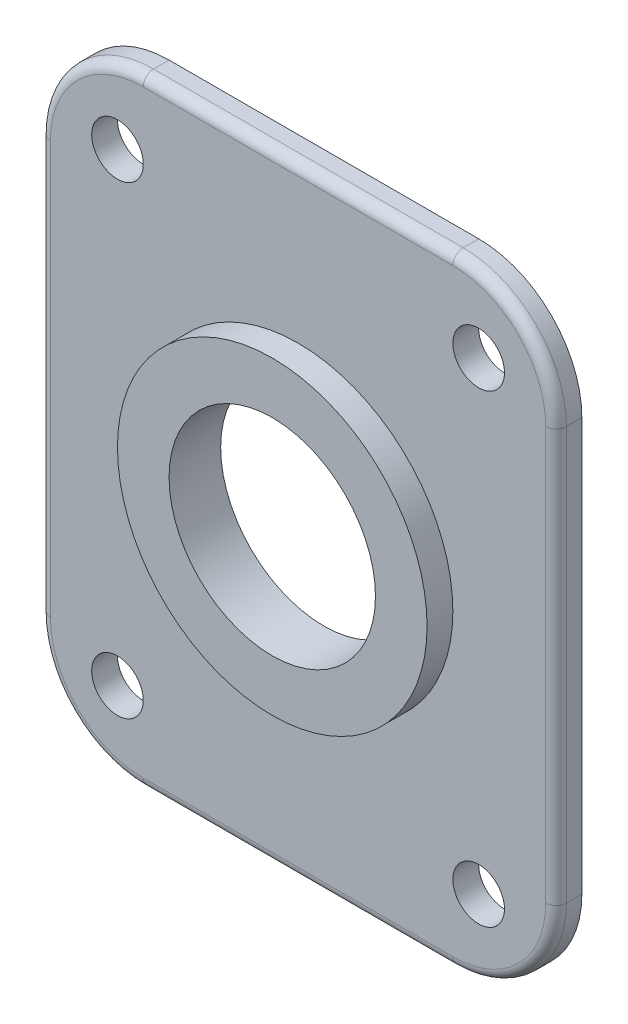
ISO-10303-21;
HEADER;
FILE_DESCRIPTION(('STEP AP214'),'2;1');
FILE_NAME('part.step','',(''),(''),'','','');
FILE_SCHEMA(('AUTOMOTIVE_DESIGN { 1 0 10303 214 1 1 1 1 }'));
ENDSEC;
DATA;
#1=APPLICATION_CONTEXT('core data for automotive mechanical design processes');
#2=APPLICATION_PROTOCOL_DEFINITION('international standard','automotive_design',2000,#1);
#3=PRODUCT_CONTEXT('',#1,'mechanical');
#4=PRODUCT('Part','Part','',(#3));
#5=PRODUCT_RELATED_PRODUCT_CATEGORY('part','',(#4));
#6=PRODUCT_DEFINITION_FORMATION('','',#4);
#7=PRODUCT_DEFINITION_CONTEXT('part definition',#1,'design');
#8=PRODUCT_DEFINITION('design','',#6,#7);
#9=PRODUCT_DEFINITION_SHAPE('','',#8);
#10=(LENGTH_UNIT() NAMED_UNIT(*) SI_UNIT(.MILLI.,.METRE.));
#11=(NAMED_UNIT(*) PLANE_ANGLE_UNIT() SI_UNIT($,.RADIAN.));
#12=(NAMED_UNIT(*) SI_UNIT($,.STERADIAN.) SOLID_ANGLE_UNIT());
#13=UNCERTAINTY_MEASURE_WITH_UNIT(LENGTH_MEASURE(1.E-05),#10,'distance_accuracy_value','');
#14=(GEOMETRIC_REPRESENTATION_CONTEXT(3) GLOBAL_UNCERTAINTY_ASSIGNED_CONTEXT((#13)) GLOBAL_UNIT_ASSIGNED_CONTEXT((#10,
#11,#12)) REPRESENTATION_CONTEXT('',''));
#15=CARTESIAN_POINT('',(0.,0.,0.));
#16=DIRECTION('',(0.,0.,1.));
#17=DIRECTION('',(1.,0.,0.));
#18=AXIS2_PLACEMENT_3D('',#15,#16,#17);
#19=CARTESIAN_POINT('',(-45.3917050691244,14.3317972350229,5.));
#20=DIRECTION('',(-1.,0.,0.));
#21=DIRECTION('',(0.,-1.,0.));
#22=AXIS2_PLACEMENT_3D('',#19,#20,#21);
#23=PLANE('',#22);
#24=DIRECTION('',(0.,0.,-1.));
#25=VECTOR('',#24,1.);
#26=CARTESIAN_POINT('',(-45.3917050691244,14.3317972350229,5.));
#27=LINE('',#26,#25);
#28=CARTESIAN_POINT('',(-45.3917050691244,14.3317972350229,3.));
#29=VERTEX_POINT('',#28);
#30=CARTESIAN_POINT('',(-45.3917050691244,14.3317972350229,0.));
#31=VERTEX_POINT('',#30);
#32=EDGE_CURVE('E202',#29,#31,#27,.T.);
#33=ORIENTED_EDGE('',*,*,#32,.F.);
#34=DIRECTION('',(0.,1.,0.));
#35=VECTOR('',#34,1.);
#36=CARTESIAN_POINT('',(-45.3917050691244,-65.6682027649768,3.));
#37=LINE('',#36,#35);
#38=CARTESIAN_POINT('',(-45.3917050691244,-65.6682027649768,3.));
#39=VERTEX_POINT('',#38);
#40=EDGE_CURVE('E46',#29,#39,#37,.F.);
#41=ORIENTED_EDGE('',*,*,#40,.T.);
#42=DIRECTION('',(0.,0.,-1.));
#43=VECTOR('',#42,1.);
#44=CARTESIAN_POINT('',(-45.3917050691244,-65.6682027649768,5.));
#45=LINE('',#44,#43);
#46=CARTESIAN_POINT('',(-45.3917050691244,-65.6682027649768,0.));
#47=VERTEX_POINT('',#46);
#48=EDGE_CURVE('E174',#39,#47,#45,.T.);
#49=ORIENTED_EDGE('',*,*,#48,.T.);
#50=DIRECTION('',(0.,1.,0.));
#51=VECTOR('',#50,1.);
#52=CARTESIAN_POINT('',(-45.3917050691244,14.3317972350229,0.));
#53=LINE('',#52,#51);
#54=EDGE_CURVE('E191',#47,#31,#53,.T.);
#55=ORIENTED_EDGE('',*,*,#54,.T.);
#56=EDGE_LOOP('',(#33,#41,#49,#55));
#57=FACE_BOUND('',#56,.T.);
#58=ADVANCED_FACE('F37',(#57),#23,.F.);
#59=CARTESIAN_POINT('',(-65.3917050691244,14.331797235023,5.));
#60=DIRECTION('',(0.,0.,-1.));
#61=DIRECTION('',(-1.,0.,0.));
#62=AXIS2_PLACEMENT_3D('',#59,#60,#61);
#63=CYLINDRICAL_SURFACE('',#62,20.);
#64=DIRECTION('',(0.,0.,-1.));
#65=VECTOR('',#64,1.);
#66=CARTESIAN_POINT('',(-65.3917050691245,34.331797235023,5.));
#67=LINE('',#66,#65);
#68=CARTESIAN_POINT('',(-65.3917050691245,34.331797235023,3.));
#69=VERTEX_POINT('',#68);
#70=CARTESIAN_POINT('',(-65.3917050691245,34.331797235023,0.));
#71=VERTEX_POINT('',#70);
#72=EDGE_CURVE('E200',#69,#71,#67,.T.);
#73=ORIENTED_EDGE('',*,*,#72,.F.);
#74=CARTESIAN_POINT('',(-65.3917050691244,14.331797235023,3.));
#75=DIRECTION('',(0.,0.,1.));
#76=DIRECTION('',(1.,0.,0.));
#77=AXIS2_PLACEMENT_3D('',#74,#75,#76);
#78=CIRCLE('',#77,20.);
#79=EDGE_CURVE('E11',#69,#29,#78,.F.);
#80=ORIENTED_EDGE('',*,*,#79,.T.);
#81=ORIENTED_EDGE('',*,*,#32,.T.);
#82=CARTESIAN_POINT('',(-65.3917050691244,14.331797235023,0.));
#83=DIRECTION('',(0.,0.,1.));
#84=DIRECTION('',(1.,0.,0.));
#85=AXIS2_PLACEMENT_3D('',#82,#83,#84);
#86=CIRCLE('',#85,20.);
#87=EDGE_CURVE('E194',#31,#71,#86,.T.);
#88=ORIENTED_EDGE('',*,*,#87,.T.);
#89=EDGE_LOOP('',(#73,#80,#81,#88));
#90=FACE_BOUND('',#89,.T.);
#91=ADVANCED_FACE('F310',(#90),#63,.T.);
#92=CARTESIAN_POINT('',(-95.3917050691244,34.331797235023,5.));
#93=DIRECTION('',(0.,-1.,0.));
#94=DIRECTION('',(0.,0.,-1.));
#95=AXIS2_PLACEMENT_3D('',#92,#93,#94);
#96=PLANE('',#95);
#97=DIRECTION('',(0.,0.,-1.));
#98=VECTOR('',#97,1.);
#99=CARTESIAN_POINT('',(-125.391705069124,34.331797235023,5.));
#100=LINE('',#99,#98);
#101=CARTESIAN_POINT('',(-125.391705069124,34.331797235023,3.));
#102=VERTEX_POINT('',#101);
#103=CARTESIAN_POINT('',(-125.391705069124,34.331797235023,0.));
#104=VERTEX_POINT('',#103);
#105=EDGE_CURVE('E182',#102,#104,#100,.T.);
#106=ORIENTED_EDGE('',*,*,#105,.F.);
#107=DIRECTION('',(-1.,0.,0.));
#108=VECTOR('',#107,1.);
#109=CARTESIAN_POINT('',(-65.3917050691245,34.331797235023,3.));
#110=LINE('',#109,#108);
#111=EDGE_CURVE('E229',#102,#69,#110,.F.);
#112=ORIENTED_EDGE('',*,*,#111,.T.);
#113=ORIENTED_EDGE('',*,*,#72,.T.);
#114=DIRECTION('',(-1.,0.,0.));
#115=VECTOR('',#114,1.);
#116=CARTESIAN_POINT('',(-95.3917050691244,34.331797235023,0.));
#117=LINE('',#116,#115);
#118=EDGE_CURVE('E197',#71,#104,#117,.T.);
#119=ORIENTED_EDGE('',*,*,#118,.T.);
#120=EDGE_LOOP('',(#106,#112,#113,#119));
#121=FACE_BOUND('',#120,.T.);
#122=ADVANCED_FACE('F280',(#121),#96,.F.);
#123=CARTESIAN_POINT('',(-65.3917050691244,14.331797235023,5.));
#124=DIRECTION('',(0.,0.,1.));
#125=DIRECTION('',(1.,0.,0.));
#126=AXIS2_PLACEMENT_3D('',#123,#124,#125);
#127=PLANE('',#126);
#128=DIRECTION('',(0.,1.,0.));
#129=VECTOR('',#128,1.);
#130=CARTESIAN_POINT('',(-143.391705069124,-65.6682027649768,5.));
#131=LINE('',#130,#129);
#132=CARTESIAN_POINT('',(-143.391705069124,14.3317972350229,5.));
#133=VERTEX_POINT('',#132);
#134=CARTESIAN_POINT('',(-143.391705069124,-65.6682027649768,5.));
#135=VERTEX_POINT('',#134);
#136=EDGE_CURVE('E219',#133,#135,#131,.F.);
#137=ORIENTED_EDGE('',*,*,#136,.T.);
#138=CARTESIAN_POINT('',(-125.391705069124,-65.6682027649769,5.));
#139=DIRECTION('',(0.,0.,1.));
#140=DIRECTION('',(1.,0.,0.));
#141=AXIS2_PLACEMENT_3D('',#138,#139,#140);
#142=CIRCLE('',#141,18.);
#143=CARTESIAN_POINT('',(-125.391705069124,-83.668202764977,5.));
#144=VERTEX_POINT('',#143);
#145=EDGE_CURVE('E221',#135,#144,#142,.T.);
#146=ORIENTED_EDGE('',*,*,#145,.T.);
#147=DIRECTION('',(-1.,0.,0.));
#148=VECTOR('',#147,1.);
#149=CARTESIAN_POINT('',(-65.3917050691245,-83.668202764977,5.));
#150=LINE('',#149,#148);
#151=CARTESIAN_POINT('',(-65.3917050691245,-83.668202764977,5.));
#152=VERTEX_POINT('',#151);
#153=EDGE_CURVE('E213',#144,#152,#150,.F.);
#154=ORIENTED_EDGE('',*,*,#153,.T.);
#155=CARTESIAN_POINT('',(-65.3917050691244,-65.668202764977,5.));
#156=DIRECTION('',(0.,0.,1.));
#157=DIRECTION('',(1.,0.,0.));
#158=AXIS2_PLACEMENT_3D('',#155,#156,#157);
#159=CIRCLE('',#158,18.);
#160=CARTESIAN_POINT('',(-47.3917050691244,-65.6682027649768,5.));
#161=VERTEX_POINT('',#160);
#162=EDGE_CURVE('E211',#152,#161,#159,.T.);
#163=ORIENTED_EDGE('',*,*,#162,.T.);
#164=DIRECTION('',(0.,1.,0.));
#165=VECTOR('',#164,1.);
#166=CARTESIAN_POINT('',(-47.3917050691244,14.3317972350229,5.));
#167=LINE('',#166,#165);
#168=CARTESIAN_POINT('',(-47.3917050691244,14.3317972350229,5.));
#169=VERTEX_POINT('',#168);
#170=EDGE_CURVE('E209',#161,#169,#167,.T.);
#171=ORIENTED_EDGE('',*,*,#170,.T.);
#172=CARTESIAN_POINT('',(-65.3917050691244,14.331797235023,5.));
#173=DIRECTION('',(0.,0.,1.));
#174=DIRECTION('',(1.,0.,0.));
#175=AXIS2_PLACEMENT_3D('',#172,#173,#174);
#176=CIRCLE('',#175,18.);
#177=CARTESIAN_POINT('',(-65.3917050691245,32.331797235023,5.));
#178=VERTEX_POINT('',#177);
#179=EDGE_CURVE('E207',#169,#178,#176,.T.);
#180=ORIENTED_EDGE('',*,*,#179,.T.);
#181=DIRECTION('',(-1.,0.,0.));
#182=VECTOR('',#181,1.);
#183=CARTESIAN_POINT('',(-125.391705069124,32.331797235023,5.));
#184=LINE('',#183,#182);
#185=CARTESIAN_POINT('',(-125.391705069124,32.331797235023,5.));
#186=VERTEX_POINT('',#185);
#187=EDGE_CURVE('E215',#178,#186,#184,.T.);
#188=ORIENTED_EDGE('',*,*,#187,.T.);
#189=CARTESIAN_POINT('',(-125.391705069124,14.331797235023,5.));
#190=DIRECTION('',(0.,0.,1.));
#191=DIRECTION('',(1.,0.,0.));
#192=AXIS2_PLACEMENT_3D('',#189,#190,#191);
#193=CIRCLE('',#192,18.);
#194=EDGE_CURVE('E217',#186,#133,#193,.T.);
#195=ORIENTED_EDGE('',*,*,#194,.T.);
#196=EDGE_LOOP('',(#137,#146,#154,#163,#171,#180,#188,#195));
#197=FACE_BOUND('',#196,.T.);
#198=CARTESIAN_POINT('',(-95.3917050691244,-25.668202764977,5.));
#199=DIRECTION('',(0.,0.,1.));
#200=DIRECTION('',(1.,0.,0.));
#201=AXIS2_PLACEMENT_3D('',#198,#199,#200);
#202=CIRCLE('',#201,30.);
#203=CARTESIAN_POINT('',(-65.3917050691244,-25.668202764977,5.));
#204=VERTEX_POINT('',#203);
#205=EDGE_CURVE('E204',#204,#204,#202,.T.);
#206=ORIENTED_EDGE('',*,*,#205,.F.);
#207=EDGE_LOOP('',(#206));
#208=FACE_BOUND('',#207,.T.);
#209=CARTESIAN_POINT('',(-60.3917050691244,19.331797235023,5.));
#210=DIRECTION('',(0.,0.,1.));
#211=DIRECTION('',(1.,0.,0.));
#212=AXIS2_PLACEMENT_3D('',#209,#210,#211);
#213=CIRCLE('',#212,5.);
#214=CARTESIAN_POINT('',(-55.3917050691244,19.331797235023,5.));
#215=VERTEX_POINT('',#214);
#216=EDGE_CURVE('E185',#215,#215,#213,.T.);
#217=ORIENTED_EDGE('',*,*,#216,.F.);
#218=EDGE_LOOP('',(#217));
#219=FACE_BOUND('',#218,.T.);
#220=CARTESIAN_POINT('',(-130.391705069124,19.331797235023,5.));
#221=DIRECTION('',(0.,0.,-1.));
#222=DIRECTION('',(-1.,0.,0.));
#223=AXIS2_PLACEMENT_3D('',#220,#221,#222);
#224=CIRCLE('',#223,5.);
#225=CARTESIAN_POINT('',(-135.391705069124,19.331797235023,5.));
#226=VERTEX_POINT('',#225);
#227=EDGE_CURVE('E176',#226,#226,#224,.T.);
#228=ORIENTED_EDGE('',*,*,#227,.T.);
#229=EDGE_LOOP('',(#228));
#230=FACE_BOUND('',#229,.T.);
#231=CARTESIAN_POINT('',(-60.3917050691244,-70.668202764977,5.));
#232=DIRECTION('',(0.,0.,-1.));
#233=DIRECTION('',(1.,0.,0.));
#234=AXIS2_PLACEMENT_3D('',#231,#232,#233);
#235=CIRCLE('',#234,5.);
#236=CARTESIAN_POINT('',(-55.3917050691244,-70.668202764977,5.));
#237=VERTEX_POINT('',#236);
#238=EDGE_CURVE('E137',#237,#237,#235,.T.);
#239=ORIENTED_EDGE('',*,*,#238,.T.);
#240=EDGE_LOOP('',(#239));
#241=FACE_BOUND('',#240,.T.);
#242=CARTESIAN_POINT('',(-130.391705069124,-70.6682027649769,5.));
#243=DIRECTION('',(0.,0.,1.));
#244=DIRECTION('',(-1.,0.,0.));
#245=AXIS2_PLACEMENT_3D('',#242,#243,#244);
#246=CIRCLE('',#245,5.);
#247=CARTESIAN_POINT('',(-135.391705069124,-70.6682027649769,5.));
#248=VERTEX_POINT('',#247);
#249=EDGE_CURVE('E161',#248,#248,#246,.T.);
#250=ORIENTED_EDGE('',*,*,#249,.F.);
#251=EDGE_LOOP('',(#250));
#252=FACE_BOUND('',#251,.T.);
#253=ADVANCED_FACE('F277',(#197,#208,#219,#230,#241,#252),#127,.T.);
#254=CARTESIAN_POINT('',(-65.3917050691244,14.331797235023,0.));
#255=DIRECTION('',(0.,0.,1.));
#256=DIRECTION('',(1.,0.,0.));
#257=AXIS2_PLACEMENT_3D('',#254,#255,#256);
#258=PLANE('',#257);
#259=CARTESIAN_POINT('',(-95.3917050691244,-25.668202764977,0.));
#260=DIRECTION('',(0.,0.,1.));
#261=DIRECTION('',(1.,0.,0.));
#262=AXIS2_PLACEMENT_3D('',#259,#260,#261);
#263=CIRCLE('',#262,20.);
#264=CARTESIAN_POINT('',(-75.3917050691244,-25.668202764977,0.));
#265=VERTEX_POINT('',#264);
#266=EDGE_CURVE('E263',#265,#265,#263,.T.);
#267=ORIENTED_EDGE('',*,*,#266,.T.);
#268=EDGE_LOOP('',(#267));
#269=FACE_BOUND('',#268,.T.);
#270=CARTESIAN_POINT('',(-60.3917050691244,19.331797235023,0.));
#271=DIRECTION('',(0.,0.,1.));
#272=DIRECTION('',(1.,0.,0.));
#273=AXIS2_PLACEMENT_3D('',#270,#271,#272);
#274=CIRCLE('',#273,5.);
#275=CARTESIAN_POINT('',(-55.3917050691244,19.331797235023,0.));
#276=VERTEX_POINT('',#275);
#277=EDGE_CURVE('E190',#276,#276,#274,.T.);
#278=ORIENTED_EDGE('',*,*,#277,.T.);
#279=EDGE_LOOP('',(#278));
#280=FACE_BOUND('',#279,.T.);
#281=ORIENTED_EDGE('',*,*,#54,.F.);
#282=CARTESIAN_POINT('',(-65.3917050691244,-65.668202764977,0.));
#283=DIRECTION('',(0.,0.,-1.));
#284=DIRECTION('',(1.,0.,0.));
#285=AXIS2_PLACEMENT_3D('',#282,#283,#284);
#286=CIRCLE('',#285,20.);
#287=CARTESIAN_POINT('',(-65.3917050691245,-85.668202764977,0.));
#288=VERTEX_POINT('',#287);
#289=EDGE_CURVE('E169',#47,#288,#286,.T.);
#290=ORIENTED_EDGE('',*,*,#289,.T.);
#291=DIRECTION('',(-1.,0.,0.));
#292=VECTOR('',#291,1.);
#293=CARTESIAN_POINT('',(-95.3917050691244,-85.668202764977,0.));
#294=LINE('',#293,#292);
#295=CARTESIAN_POINT('',(-125.391705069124,-85.6682027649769,0.));
#296=VERTEX_POINT('',#295);
#297=EDGE_CURVE('E156',#288,#296,#294,.T.);
#298=ORIENTED_EDGE('',*,*,#297,.T.);
#299=CARTESIAN_POINT('',(-125.391705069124,-65.6682027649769,0.));
#300=DIRECTION('',(0.,0.,1.));
#301=DIRECTION('',(-1.,0.,0.));
#302=AXIS2_PLACEMENT_3D('',#299,#300,#301);
#303=CIRCLE('',#302,20.);
#304=CARTESIAN_POINT('',(-145.391705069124,-65.6682027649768,0.));
#305=VERTEX_POINT('',#304);
#306=EDGE_CURVE('E132',#305,#296,#303,.T.);
#307=ORIENTED_EDGE('',*,*,#306,.F.);
#308=DIRECTION('',(0.,1.,0.));
#309=VECTOR('',#308,1.);
#310=CARTESIAN_POINT('',(-145.391705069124,14.3317972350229,0.));
#311=LINE('',#310,#309);
#312=CARTESIAN_POINT('',(-145.391705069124,14.3317972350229,0.));
#313=VERTEX_POINT('',#312);
#314=EDGE_CURVE('E141',#305,#313,#311,.T.);
#315=ORIENTED_EDGE('',*,*,#314,.T.);
#316=CARTESIAN_POINT('',(-125.391705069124,14.331797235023,0.));
#317=DIRECTION('',(0.,0.,-1.));
#318=DIRECTION('',(-1.,0.,0.));
#319=AXIS2_PLACEMENT_3D('',#316,#317,#318);
#320=CIRCLE('',#319,20.);
#321=EDGE_CURVE('E148',#313,#104,#320,.T.);
#322=ORIENTED_EDGE('',*,*,#321,.T.);
#323=ORIENTED_EDGE('',*,*,#118,.F.);
#324=ORIENTED_EDGE('',*,*,#87,.F.);
#325=EDGE_LOOP('',(#281,#290,#298,#307,#315,#322,#323,#324));
#326=FACE_BOUND('',#325,.T.);
#327=CARTESIAN_POINT('',(-130.391705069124,19.331797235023,0.));
#328=DIRECTION('',(0.,0.,-1.));
#329=DIRECTION('',(-1.,0.,0.));
#330=AXIS2_PLACEMENT_3D('',#327,#328,#329);
#331=CIRCLE('',#330,5.);
#332=CARTESIAN_POINT('',(-135.391705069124,19.331797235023,0.));
#333=VERTEX_POINT('',#332);
#334=EDGE_CURVE('E149',#333,#333,#331,.T.);
#335=ORIENTED_EDGE('',*,*,#334,.F.);
#336=EDGE_LOOP('',(#335));
#337=FACE_BOUND('',#336,.T.);
#338=CARTESIAN_POINT('',(-60.3917050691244,-70.668202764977,0.));
#339=DIRECTION('',(0.,0.,-1.));
#340=DIRECTION('',(1.,0.,0.));
#341=AXIS2_PLACEMENT_3D('',#338,#339,#340);
#342=CIRCLE('',#341,5.);
#343=CARTESIAN_POINT('',(-55.3917050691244,-70.668202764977,0.));
#344=VERTEX_POINT('',#343);
#345=EDGE_CURVE('E168',#344,#344,#342,.T.);
#346=ORIENTED_EDGE('',*,*,#345,.F.);
#347=EDGE_LOOP('',(#346));
#348=FACE_BOUND('',#347,.T.);
#349=CARTESIAN_POINT('',(-130.391705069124,-70.6682027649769,0.));
#350=DIRECTION('',(0.,0.,1.));
#351=DIRECTION('',(-1.,0.,0.));
#352=AXIS2_PLACEMENT_3D('',#349,#350,#351);
#353=CIRCLE('',#352,5.);
#354=CARTESIAN_POINT('',(-135.391705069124,-70.6682027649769,0.));
#355=VERTEX_POINT('',#354);
#356=EDGE_CURVE('E157',#355,#355,#353,.T.);
#357=ORIENTED_EDGE('',*,*,#356,.T.);
#358=EDGE_LOOP('',(#357));
#359=FACE_BOUND('',#358,.T.);
#360=ADVANCED_FACE('F152',(#269,#280,#326,#337,#348,#359),#258,.F.);
#361=CARTESIAN_POINT('',(-60.3917050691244,19.331797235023,-5.));
#362=DIRECTION('',(0.,0.,1.));
#363=DIRECTION('',(1.,0.,0.));
#364=AXIS2_PLACEMENT_3D('',#361,#362,#363);
#365=CYLINDRICAL_SURFACE('',#364,5.);
#366=ORIENTED_EDGE('',*,*,#216,.T.);
#367=EDGE_LOOP('',(#366));
#368=FACE_BOUND('',#367,.T.);
#369=ORIENTED_EDGE('',*,*,#277,.F.);
#370=EDGE_LOOP('',(#369));
#371=FACE_BOUND('',#370,.T.);
#372=ADVANCED_FACE('F299',(#368,#371),#365,.F.);
#373=CARTESIAN_POINT('',(-145.391705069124,14.3317972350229,5.));
#374=DIRECTION('',(1.,0.,0.));
#375=DIRECTION('',(0.,-1.,0.));
#376=AXIS2_PLACEMENT_3D('',#373,#374,#375);
#377=PLANE('',#376);
#378=DIRECTION('',(0.,0.,-1.));
#379=VECTOR('',#378,1.);
#380=CARTESIAN_POINT('',(-145.391705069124,-65.6682027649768,5.));
#381=LINE('',#380,#379);
#382=CARTESIAN_POINT('',(-145.391705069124,-65.6682027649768,3.));
#383=VERTEX_POINT('',#382);
#384=EDGE_CURVE('E127',#383,#305,#381,.T.);
#385=ORIENTED_EDGE('',*,*,#384,.F.);
#386=DIRECTION('',(0.,1.,0.));
#387=VECTOR('',#386,1.);
#388=CARTESIAN_POINT('',(-145.391705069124,14.3317972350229,3.));
#389=LINE('',#388,#387);
#390=CARTESIAN_POINT('',(-145.391705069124,14.3317972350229,3.));
#391=VERTEX_POINT('',#390);
#392=EDGE_CURVE('E225',#383,#391,#389,.T.);
#393=ORIENTED_EDGE('',*,*,#392,.T.);
#394=DIRECTION('',(0.,0.,-1.));
#395=VECTOR('',#394,1.);
#396=CARTESIAN_POINT('',(-145.391705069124,14.3317972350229,5.));
#397=LINE('',#396,#395);
#398=EDGE_CURVE('E144',#391,#313,#397,.T.);
#399=ORIENTED_EDGE('',*,*,#398,.T.);
#400=ORIENTED_EDGE('',*,*,#314,.F.);
#401=EDGE_LOOP('',(#385,#393,#399,#400));
#402=FACE_BOUND('',#401,.T.);
#403=ADVANCED_FACE('F142',(#402),#377,.F.);
#404=CARTESIAN_POINT('',(-125.391705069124,14.331797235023,5.));
#405=DIRECTION('',(0.,0.,-1.));
#406=DIRECTION('',(1.,0.,0.));
#407=AXIS2_PLACEMENT_3D('',#404,#405,#406);
#408=CYLINDRICAL_SURFACE('',#407,20.);
#409=ORIENTED_EDGE('',*,*,#398,.F.);
#410=CARTESIAN_POINT('',(-125.391705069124,14.331797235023,3.));
#411=DIRECTION('',(0.,0.,1.));
#412=DIRECTION('',(1.,0.,0.));
#413=AXIS2_PLACEMENT_3D('',#410,#411,#412);
#414=CIRCLE('',#413,20.);
#415=EDGE_CURVE('E227',#391,#102,#414,.F.);
#416=ORIENTED_EDGE('',*,*,#415,.T.);
#417=ORIENTED_EDGE('',*,*,#105,.T.);
#418=ORIENTED_EDGE('',*,*,#321,.F.);
#419=EDGE_LOOP('',(#409,#416,#417,#418));
#420=FACE_BOUND('',#419,.T.);
#421=ADVANCED_FACE('F378',(#420),#408,.T.);
#422=CARTESIAN_POINT('',(-130.391705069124,19.331797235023,-5.));
#423=DIRECTION('',(0.,0.,1.));
#424=DIRECTION('',(-1.,0.,0.));
#425=AXIS2_PLACEMENT_3D('',#422,#423,#424);
#426=CYLINDRICAL_SURFACE('',#425,5.);
#427=ORIENTED_EDGE('',*,*,#227,.F.);
#428=EDGE_LOOP('',(#427));
#429=FACE_BOUND('',#428,.T.);
#430=ORIENTED_EDGE('',*,*,#334,.T.);
#431=EDGE_LOOP('',(#430));
#432=FACE_BOUND('',#431,.T.);
#433=ADVANCED_FACE('F380',(#429,#432),#426,.F.);
#434=CARTESIAN_POINT('',(-65.3917050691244,-65.668202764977,5.));
#435=DIRECTION('',(0.,0.,-1.));
#436=DIRECTION('',(-1.,0.,0.));
#437=AXIS2_PLACEMENT_3D('',#434,#435,#436);
#438=CYLINDRICAL_SURFACE('',#437,20.);
#439=ORIENTED_EDGE('',*,*,#48,.F.);
#440=CARTESIAN_POINT('',(-65.3917050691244,-65.668202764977,3.));
#441=DIRECTION('',(0.,0.,1.));
#442=DIRECTION('',(1.,0.,0.));
#443=AXIS2_PLACEMENT_3D('',#440,#441,#442);
#444=CIRCLE('',#443,20.);
#445=CARTESIAN_POINT('',(-65.3917050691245,-85.668202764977,3.));
#446=VERTEX_POINT('',#445);
#447=EDGE_CURVE('E233',#39,#446,#444,.F.);
#448=ORIENTED_EDGE('',*,*,#447,.T.);
#449=DIRECTION('',(0.,0.,-1.));
#450=VECTOR('',#449,1.);
#451=CARTESIAN_POINT('',(-65.3917050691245,-85.668202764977,5.));
#452=LINE('',#451,#450);
#453=EDGE_CURVE('E172',#446,#288,#452,.T.);
#454=ORIENTED_EDGE('',*,*,#453,.T.);
#455=ORIENTED_EDGE('',*,*,#289,.F.);
#456=EDGE_LOOP('',(#439,#448,#454,#455));
#457=FACE_BOUND('',#456,.T.);
#458=ADVANCED_FACE('F359',(#457),#438,.T.);
#459=CARTESIAN_POINT('',(-95.3917050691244,-85.668202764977,5.));
#460=DIRECTION('',(0.,1.,0.));
#461=DIRECTION('',(0.,0.,-1.));
#462=AXIS2_PLACEMENT_3D('',#459,#460,#461);
#463=PLANE('',#462);
#464=ORIENTED_EDGE('',*,*,#453,.F.);
#465=DIRECTION('',(-1.,0.,0.));
#466=VECTOR('',#465,1.);
#467=CARTESIAN_POINT('',(-125.391705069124,-85.668202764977,3.));
#468=LINE('',#467,#466);
#469=CARTESIAN_POINT('',(-125.391705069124,-85.6682027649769,3.));
#470=VERTEX_POINT('',#469);
#471=EDGE_CURVE('E231',#446,#470,#468,.T.);
#472=ORIENTED_EDGE('',*,*,#471,.T.);
#473=DIRECTION('',(0.,0.,-1.));
#474=VECTOR('',#473,1.);
#475=CARTESIAN_POINT('',(-125.391705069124,-85.6682027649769,5.));
#476=LINE('',#475,#474);
#477=EDGE_CURVE('E138',#470,#296,#476,.T.);
#478=ORIENTED_EDGE('',*,*,#477,.T.);
#479=ORIENTED_EDGE('',*,*,#297,.F.);
#480=EDGE_LOOP('',(#464,#472,#478,#479));
#481=FACE_BOUND('',#480,.T.);
#482=ADVANCED_FACE('F362',(#481),#463,.F.);
#483=CARTESIAN_POINT('',(-60.3917050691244,-70.668202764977,-5.));
#484=DIRECTION('',(0.,0.,1.));
#485=DIRECTION('',(1.,0.,0.));
#486=AXIS2_PLACEMENT_3D('',#483,#484,#485);
#487=CYLINDRICAL_SURFACE('',#486,5.);
#488=ORIENTED_EDGE('',*,*,#238,.F.);
#489=EDGE_LOOP('',(#488));
#490=FACE_BOUND('',#489,.T.);
#491=ORIENTED_EDGE('',*,*,#345,.T.);
#492=EDGE_LOOP('',(#491));
#493=FACE_BOUND('',#492,.T.);
#494=ADVANCED_FACE('F394',(#490,#493),#487,.F.);
#495=CARTESIAN_POINT('',(-125.391705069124,-65.6682027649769,5.));
#496=DIRECTION('',(0.,0.,-1.));
#497=DIRECTION('',(1.,0.,0.));
#498=AXIS2_PLACEMENT_3D('',#495,#496,#497);
#499=CYLINDRICAL_SURFACE('',#498,20.);
#500=ORIENTED_EDGE('',*,*,#477,.F.);
#501=CARTESIAN_POINT('',(-125.391705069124,-65.6682027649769,3.));
#502=DIRECTION('',(0.,0.,1.));
#503=DIRECTION('',(1.,0.,0.));
#504=AXIS2_PLACEMENT_3D('',#501,#502,#503);
#505=CIRCLE('',#504,20.);
#506=EDGE_CURVE('E135',#470,#383,#505,.F.);
#507=ORIENTED_EDGE('',*,*,#506,.T.);
#508=ORIENTED_EDGE('',*,*,#384,.T.);
#509=ORIENTED_EDGE('',*,*,#306,.T.);
#510=EDGE_LOOP('',(#500,#507,#508,#509));
#511=FACE_BOUND('',#510,.T.);
#512=ADVANCED_FACE('F130',(#511),#499,.T.);
#513=CARTESIAN_POINT('',(-130.391705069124,-70.6682027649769,-5.));
#514=DIRECTION('',(0.,0.,1.));
#515=DIRECTION('',(-1.,0.,0.));
#516=AXIS2_PLACEMENT_3D('',#513,#514,#515);
#517=CYLINDRICAL_SURFACE('',#516,5.);
#518=ORIENTED_EDGE('',*,*,#249,.T.);
#519=EDGE_LOOP('',(#518));
#520=FACE_BOUND('',#519,.T.);
#521=ORIENTED_EDGE('',*,*,#356,.F.);
#522=EDGE_LOOP('',(#521));
#523=FACE_BOUND('',#522,.T.);
#524=ADVANCED_FACE('F292',(#520,#523),#517,.F.);
#525=CARTESIAN_POINT('',(-95.3917050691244,-25.668202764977,10.));
#526=DIRECTION('',(0.,0.,-1.));
#527=DIRECTION('',(-1.,0.,0.));
#528=AXIS2_PLACEMENT_3D('',#525,#526,#527);
#529=CYLINDRICAL_SURFACE('',#528,30.);
#530=CARTESIAN_POINT('',(-95.3917050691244,-25.668202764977,10.));
#531=DIRECTION('',(0.,0.,1.));
#532=DIRECTION('',(1.,0.,0.));
#533=AXIS2_PLACEMENT_3D('',#530,#531,#532);
#534=CIRCLE('',#533,30.);
#535=CARTESIAN_POINT('',(-65.3917050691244,-25.668202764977,10.));
#536=VERTEX_POINT('',#535);
#537=EDGE_CURVE('E268',#536,#536,#534,.T.);
#538=ORIENTED_EDGE('',*,*,#537,.F.);
#539=EDGE_LOOP('',(#538));
#540=FACE_BOUND('',#539,.T.);
#541=ORIENTED_EDGE('',*,*,#205,.T.);
#542=EDGE_LOOP('',(#541));
#543=FACE_BOUND('',#542,.T.);
#544=ADVANCED_FACE('F275',(#540,#543),#529,.T.);
#545=CARTESIAN_POINT('',(-95.3917050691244,-25.668202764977,10.));
#546=DIRECTION('',(0.,0.,1.));
#547=DIRECTION('',(1.,0.,0.));
#548=AXIS2_PLACEMENT_3D('',#545,#546,#547);
#549=PLANE('',#548);
#550=CARTESIAN_POINT('',(-95.3917050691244,-25.668202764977,10.));
#551=DIRECTION('',(0.,0.,1.));
#552=DIRECTION('',(1.,0.,0.));
#553=AXIS2_PLACEMENT_3D('',#550,#551,#552);
#554=CIRCLE('',#553,20.);
#555=CARTESIAN_POINT('',(-75.3917050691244,-25.668202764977,10.));
#556=VERTEX_POINT('',#555);
#557=EDGE_CURVE('E257',#556,#556,#554,.T.);
#558=ORIENTED_EDGE('',*,*,#557,.F.);
#559=EDGE_LOOP('',(#558));
#560=FACE_BOUND('',#559,.T.);
#561=ORIENTED_EDGE('',*,*,#537,.T.);
#562=EDGE_LOOP('',(#561));
#563=FACE_BOUND('',#562,.T.);
#564=ADVANCED_FACE('F349',(#560,#563),#549,.T.);
#565=CARTESIAN_POINT('',(-95.3917050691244,-25.668202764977,-15.));
#566=DIRECTION('',(0.,0.,1.));
#567=DIRECTION('',(1.,0.,0.));
#568=AXIS2_PLACEMENT_3D('',#565,#566,#567);
#569=CYLINDRICAL_SURFACE('',#568,20.);
#570=ORIENTED_EDGE('',*,*,#557,.T.);
#571=EDGE_LOOP('',(#570));
#572=FACE_BOUND('',#571,.T.);
#573=ORIENTED_EDGE('',*,*,#266,.F.);
#574=EDGE_LOOP('',(#573));
#575=FACE_BOUND('',#574,.T.);
#576=ADVANCED_FACE('F344',(#572,#575),#569,.F.);
#577=CARTESIAN_POINT('',(-65.3917050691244,14.331797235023,3.));
#578=DIRECTION('',(0.,0.,1.));
#579=DIRECTION('',(1.,0.,0.));
#580=AXIS2_PLACEMENT_3D('',#577,#578,#579);
#581=TOROIDAL_SURFACE('',#580,18.,2.);
#582=CARTESIAN_POINT('',(-47.3917050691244,14.3317972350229,3.));
#583=DIRECTION('',(0.,-1.,0.));
#584=DIRECTION('',(0.,0.,-1.));
#585=AXIS2_PLACEMENT_3D('',#582,#583,#584);
#586=CIRCLE('',#585,2.);
#587=EDGE_CURVE('E251',#29,#169,#586,.T.);
#588=ORIENTED_EDGE('',*,*,#587,.F.);
#589=ORIENTED_EDGE('',*,*,#79,.F.);
#590=CARTESIAN_POINT('',(-65.3917050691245,32.331797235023,3.));
#591=DIRECTION('',(-1.,0.,0.));
#592=DIRECTION('',(0.,0.,1.));
#593=AXIS2_PLACEMENT_3D('',#590,#591,#592);
#594=CIRCLE('',#593,2.);
#595=EDGE_CURVE('E41',#178,#69,#594,.T.);
#596=ORIENTED_EDGE('',*,*,#595,.F.);
#597=ORIENTED_EDGE('',*,*,#179,.F.);
#598=EDGE_LOOP('',(#588,#589,#596,#597));
#599=FACE_BOUND('',#598,.T.);
#600=ADVANCED_FACE('F39',(#599),#581,.T.);
#601=CARTESIAN_POINT('',(-65.3917050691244,32.331797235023,3.));
#602=DIRECTION('',(1.,0.,0.));
#603=DIRECTION('',(0.,0.,-1.));
#604=AXIS2_PLACEMENT_3D('',#601,#602,#603);
#605=CYLINDRICAL_SURFACE('',#604,2.);
#606=ORIENTED_EDGE('',*,*,#595,.T.);
#607=ORIENTED_EDGE('',*,*,#111,.F.);
#608=CARTESIAN_POINT('',(-125.391705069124,32.331797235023,3.));
#609=DIRECTION('',(-1.,0.,0.));
#610=DIRECTION('',(0.,-1.,0.));
#611=AXIS2_PLACEMENT_3D('',#608,#609,#610);
#612=CIRCLE('',#611,2.);
#613=EDGE_CURVE('E249',#186,#102,#612,.T.);
#614=ORIENTED_EDGE('',*,*,#613,.F.);
#615=ORIENTED_EDGE('',*,*,#187,.F.);
#616=EDGE_LOOP('',(#606,#607,#614,#615));
#617=FACE_BOUND('',#616,.T.);
#618=ADVANCED_FACE('F339',(#617),#605,.T.);
#619=CARTESIAN_POINT('',(-47.3917050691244,14.331797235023,3.));
#620=DIRECTION('',(0.,-1.,0.));
#621=DIRECTION('',(1.,0.,0.));
#622=AXIS2_PLACEMENT_3D('',#619,#620,#621);
#623=CYLINDRICAL_SURFACE('',#622,2.);
#624=ORIENTED_EDGE('',*,*,#587,.T.);
#625=ORIENTED_EDGE('',*,*,#170,.F.);
#626=CARTESIAN_POINT('',(-47.3917050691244,-65.6682027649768,3.));
#627=DIRECTION('',(0.,-1.,0.));
#628=DIRECTION('',(0.,0.,-1.));
#629=AXIS2_PLACEMENT_3D('',#626,#627,#628);
#630=CIRCLE('',#629,2.);
#631=EDGE_CURVE('E246',#39,#161,#630,.T.);
#632=ORIENTED_EDGE('',*,*,#631,.F.);
#633=ORIENTED_EDGE('',*,*,#40,.F.);
#634=EDGE_LOOP('',(#624,#625,#632,#633));
#635=FACE_BOUND('',#634,.T.);
#636=ADVANCED_FACE('F336',(#635),#623,.T.);
#637=CARTESIAN_POINT('',(-125.391705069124,14.331797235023,3.));
#638=DIRECTION('',(0.,0.,1.));
#639=DIRECTION('',(1.,0.,0.));
#640=AXIS2_PLACEMENT_3D('',#637,#638,#639);
#641=TOROIDAL_SURFACE('',#640,18.,2.);
#642=ORIENTED_EDGE('',*,*,#613,.T.);
#643=ORIENTED_EDGE('',*,*,#415,.F.);
#644=CARTESIAN_POINT('',(-143.391705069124,14.3317972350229,3.));
#645=DIRECTION('',(0.,-1.,0.));
#646=DIRECTION('',(0.,0.,-1.));
#647=AXIS2_PLACEMENT_3D('',#644,#645,#646);
#648=CIRCLE('',#647,2.);
#649=EDGE_CURVE('E243',#133,#391,#648,.T.);
#650=ORIENTED_EDGE('',*,*,#649,.F.);
#651=ORIENTED_EDGE('',*,*,#194,.F.);
#652=EDGE_LOOP('',(#642,#643,#650,#651));
#653=FACE_BOUND('',#652,.T.);
#654=ADVANCED_FACE('F332',(#653),#641,.T.);
#655=CARTESIAN_POINT('',(-65.3917050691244,-65.668202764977,3.));
#656=DIRECTION('',(0.,0.,1.));
#657=DIRECTION('',(1.,0.,0.));
#658=AXIS2_PLACEMENT_3D('',#655,#656,#657);
#659=TOROIDAL_SURFACE('',#658,18.,2.);
#660=ORIENTED_EDGE('',*,*,#631,.T.);
#661=ORIENTED_EDGE('',*,*,#162,.F.);
#662=CARTESIAN_POINT('',(-65.3917050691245,-83.668202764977,3.));
#663=DIRECTION('',(-1.,0.,0.));
#664=DIRECTION('',(0.,0.,1.));
#665=AXIS2_PLACEMENT_3D('',#662,#663,#664);
#666=CIRCLE('',#665,2.);
#667=EDGE_CURVE('E240',#446,#152,#666,.T.);
#668=ORIENTED_EDGE('',*,*,#667,.F.);
#669=ORIENTED_EDGE('',*,*,#447,.F.);
#670=EDGE_LOOP('',(#660,#661,#668,#669));
#671=FACE_BOUND('',#670,.T.);
#672=ADVANCED_FACE('F328',(#671),#659,.T.);
#673=CARTESIAN_POINT('',(-143.391705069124,14.3317972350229,3.));
#674=DIRECTION('',(0.,-1.,0.));
#675=DIRECTION('',(1.,0.,0.));
#676=AXIS2_PLACEMENT_3D('',#673,#674,#675);
#677=CYLINDRICAL_SURFACE('',#676,2.);
#678=ORIENTED_EDGE('',*,*,#649,.T.);
#679=ORIENTED_EDGE('',*,*,#392,.F.);
#680=CARTESIAN_POINT('',(-143.391705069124,-65.6682027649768,3.));
#681=DIRECTION('',(0.,-1.,0.));
#682=DIRECTION('',(1.,0.,0.));
#683=AXIS2_PLACEMENT_3D('',#680,#681,#682);
#684=CIRCLE('',#683,2.);
#685=EDGE_CURVE('E238',#135,#383,#684,.T.);
#686=ORIENTED_EDGE('',*,*,#685,.F.);
#687=ORIENTED_EDGE('',*,*,#136,.F.);
#688=EDGE_LOOP('',(#678,#679,#686,#687));
#689=FACE_BOUND('',#688,.T.);
#690=ADVANCED_FACE('F324',(#689),#677,.T.);
#691=CARTESIAN_POINT('',(-95.3917050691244,-83.668202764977,3.));
#692=DIRECTION('',(1.,0.,0.));
#693=DIRECTION('',(0.,0.,-1.));
#694=AXIS2_PLACEMENT_3D('',#691,#692,#693);
#695=CYLINDRICAL_SURFACE('',#694,2.);
#696=ORIENTED_EDGE('',*,*,#667,.T.);
#697=ORIENTED_EDGE('',*,*,#153,.F.);
#698=CARTESIAN_POINT('',(-125.391705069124,-83.668202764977,3.));
#699=DIRECTION('',(-1.,0.,0.));
#700=DIRECTION('',(0.,0.,1.));
#701=AXIS2_PLACEMENT_3D('',#698,#699,#700);
#702=CIRCLE('',#701,2.);
#703=EDGE_CURVE('E236',#470,#144,#702,.T.);
#704=ORIENTED_EDGE('',*,*,#703,.F.);
#705=ORIENTED_EDGE('',*,*,#471,.F.);
#706=EDGE_LOOP('',(#696,#697,#704,#705));
#707=FACE_BOUND('',#706,.T.);
#708=ADVANCED_FACE('F320',(#707),#695,.T.);
#709=CARTESIAN_POINT('',(-125.391705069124,-65.6682027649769,3.));
#710=DIRECTION('',(0.,0.,1.));
#711=DIRECTION('',(1.,0.,0.));
#712=AXIS2_PLACEMENT_3D('',#709,#710,#711);
#713=TOROIDAL_SURFACE('',#712,18.,2.);
#714=ORIENTED_EDGE('',*,*,#685,.T.);
#715=ORIENTED_EDGE('',*,*,#506,.F.);
#716=ORIENTED_EDGE('',*,*,#703,.T.);
#717=ORIENTED_EDGE('',*,*,#145,.F.);
#718=EDGE_LOOP('',(#714,#715,#716,#717));
#719=FACE_BOUND('',#718,.T.);
#720=ADVANCED_FACE('F317',(#719),#713,.T.);
#721=CLOSED_SHELL('',(#58,#91,#122,#253,#360,#372,#403,#421,#433,#458,#482,#494,#512,#524,#544,
#564,#576,#600,#618,#636,#654,#672,#690,#708,#720));
#722=MANIFOLD_SOLID_BREP('B2',#721);
#723=ADVANCED_BREP_SHAPE_REPRESENTATION('',(#18,#722),#14);
#724=SHAPE_DEFINITION_REPRESENTATION(#9,#723);
ENDSEC;
END-ISO-10303-21;
